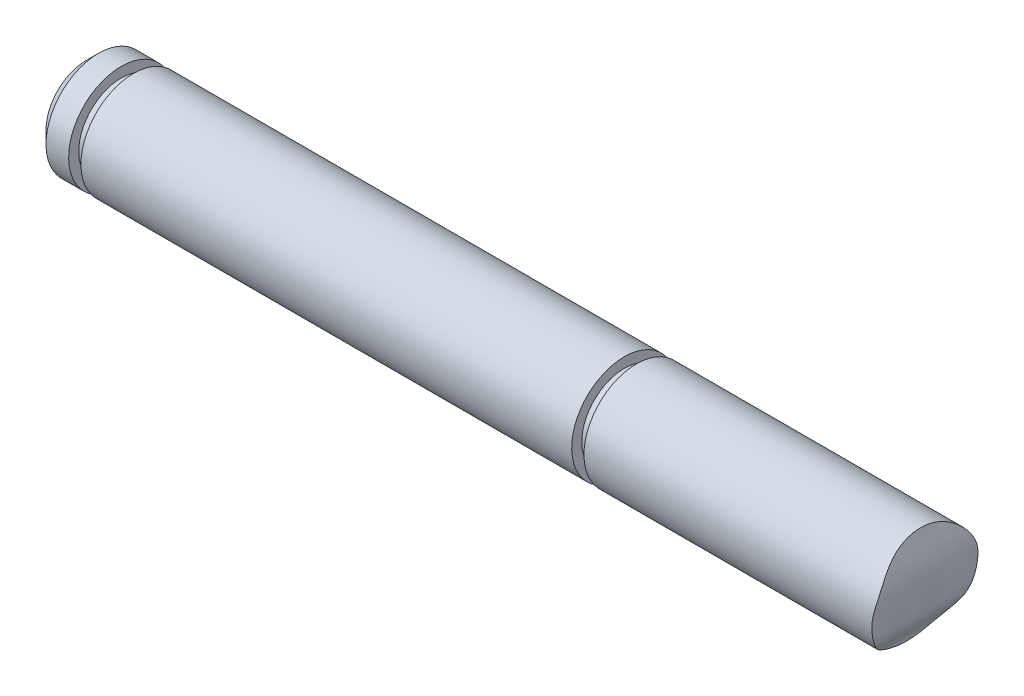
ISO-10303-21;
HEADER;
FILE_DESCRIPTION(('STEP AP214'),'2;1');
FILE_NAME('part.step','',(''),(''),'','','');
FILE_SCHEMA(('AUTOMOTIVE_DESIGN { 1 0 10303 214 1 1 1 1 }'));
ENDSEC;
DATA;
#1=APPLICATION_CONTEXT('core data for automotive mechanical design processes');
#2=APPLICATION_PROTOCOL_DEFINITION('international standard','automotive_design',2000,#1);
#3=PRODUCT_CONTEXT('',#1,'mechanical');
#4=PRODUCT('Part','Part','',(#3));
#5=PRODUCT_RELATED_PRODUCT_CATEGORY('part','',(#4));
#6=PRODUCT_DEFINITION_FORMATION('','',#4);
#7=PRODUCT_DEFINITION_CONTEXT('part definition',#1,'design');
#8=PRODUCT_DEFINITION('design','',#6,#7);
#9=PRODUCT_DEFINITION_SHAPE('','',#8);
#10=(LENGTH_UNIT() NAMED_UNIT(*) SI_UNIT(.MILLI.,.METRE.));
#11=(NAMED_UNIT(*) PLANE_ANGLE_UNIT() SI_UNIT($,.RADIAN.));
#12=(NAMED_UNIT(*) SI_UNIT($,.STERADIAN.) SOLID_ANGLE_UNIT());
#13=UNCERTAINTY_MEASURE_WITH_UNIT(LENGTH_MEASURE(1.E-05),#10,'distance_accuracy_value','');
#14=(GEOMETRIC_REPRESENTATION_CONTEXT(3) GLOBAL_UNCERTAINTY_ASSIGNED_CONTEXT((#13)) GLOBAL_UNIT_ASSIGNED_CONTEXT((#10,
#11,#12)) REPRESENTATION_CONTEXT('',''));
#15=CARTESIAN_POINT('',(0.,0.,0.));
#16=DIRECTION('',(0.,0.,1.));
#17=DIRECTION('',(1.,0.,0.));
#18=AXIS2_PLACEMENT_3D('',#15,#16,#17);
#19=CARTESIAN_POINT('',(19.4973294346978,5.21361750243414,0.));
#20=DIRECTION('',(1.,0.,0.));
#21=DIRECTION('',(0.,1.,0.));
#22=AXIS2_PLACEMENT_3D('',#19,#20,#21);
#23=CYLINDRICAL_SURFACE('',#22,3.);
#24=CARTESIAN_POINT('',(-0.502670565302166,5.21361750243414,0.));
#25=DIRECTION('',(1.,0.,0.));
#26=DIRECTION('',(0.,1.,0.));
#27=AXIS2_PLACEMENT_3D('',#24,#25,#26);
#28=CIRCLE('',#27,3.);
#29=CARTESIAN_POINT('',(-0.502670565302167,8.21361750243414,0.));
#30=VERTEX_POINT('',#29);
#31=EDGE_CURVE('E70',#30,#30,#28,.T.);
#32=ORIENTED_EDGE('',*,*,#31,.T.);
#33=EDGE_LOOP('',(#32));
#34=FACE_BOUND('',#33,.T.);
#35=CARTESIAN_POINT('',(15.700123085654,8.21361750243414,0.));
#36=CARTESIAN_POINT('',(15.7001231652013,8.21361762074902,-0.0832513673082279));
#37=CARTESIAN_POINT('',(15.7010054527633,8.2101497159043,-0.166500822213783));
#38=CARTESIAN_POINT('',(15.7045770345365,8.19630618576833,-0.332415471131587));
#39=CARTESIAN_POINT('',(15.7072669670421,8.18592812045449,-0.415080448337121));
#40=CARTESIAN_POINT('',(15.7145693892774,8.1583409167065,-0.579257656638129));
#41=CARTESIAN_POINT('',(15.7191837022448,8.14112530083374,-0.660768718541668));
#42=CARTESIAN_POINT('',(15.7304788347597,8.10002090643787,-0.821943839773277));
#43=CARTESIAN_POINT('',(15.7371596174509,8.07613224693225,-0.901607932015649));
#44=CARTESIAN_POINT('',(15.752521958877,8.02254549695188,-1.0566415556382));
#45=CARTESIAN_POINT('',(15.7611526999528,7.99299744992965,-1.13206804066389));
#46=CARTESIAN_POINT('',(15.7805163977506,7.92803252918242,-1.28002996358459));
#47=CARTESIAN_POINT('',(15.7912484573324,7.89261816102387,-1.35256661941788));
#48=CARTESIAN_POINT('',(15.8147072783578,7.81618899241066,-1.49436078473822));
#49=CARTESIAN_POINT('',(15.82743559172,7.77516983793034,-1.56361568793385));
#50=CARTESIAN_POINT('',(15.8545683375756,7.6878767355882,-1.69837785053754));
#51=CARTESIAN_POINT('',(15.8689727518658,7.64160284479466,-1.76388515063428));
#52=CARTESIAN_POINT('',(15.8991432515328,7.54336548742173,-1.89179195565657));
#53=CARTESIAN_POINT('',(15.9149267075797,7.49132622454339,-1.95412908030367));
#54=CARTESIAN_POINT('',(15.9468179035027,7.38241655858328,-2.07434067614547));
#55=CARTESIAN_POINT('',(15.9629256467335,7.32554610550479,-2.13221510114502));
#56=CARTESIAN_POINT('',(15.9942752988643,7.20727117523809,-2.24319278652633));
#57=CARTESIAN_POINT('',(16.0095184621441,7.14587358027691,-2.29630302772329));
#58=CARTESIAN_POINT('',(16.0376177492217,7.0186306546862,-2.3976099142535));
#59=CARTESIAN_POINT('',(16.0504748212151,6.95278710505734,-2.44580850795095));
#60=CARTESIAN_POINT('',(16.0655569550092,6.85670201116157,-2.51026354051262));
#61=CARTESIAN_POINT('',(16.069599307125,6.82818935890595,-2.52869794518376));
#62=CARTESIAN_POINT('',(16.0767419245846,6.77047063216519,-2.56463726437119));
#63=CARTESIAN_POINT('',(16.0798422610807,6.74126461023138,-2.58214224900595));
#64=CARTESIAN_POINT('',(16.0876081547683,6.65268618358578,-2.63319600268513));
#65=CARTESIAN_POINT('',(16.0907424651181,6.59232985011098,-2.66529939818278));
#66=CARTESIAN_POINT('',(16.0931009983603,6.46956896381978,-2.72529858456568));
#67=CARTESIAN_POINT('',(16.0923285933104,6.4071662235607,-2.75319798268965));
#68=CARTESIAN_POINT('',(16.0872824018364,6.28071424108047,-2.80463271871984));
#69=CARTESIAN_POINT('',(16.0830077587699,6.21666459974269,-2.82816698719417));
#70=CARTESIAN_POINT('',(16.0716253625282,6.08781434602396,-2.87060089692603));
#71=CARTESIAN_POINT('',(16.0645379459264,6.02302229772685,-2.88953226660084));
#72=CARTESIAN_POINT('',(16.0482894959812,5.89256889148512,-2.92293673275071));
#73=CARTESIAN_POINT('',(16.0391285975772,5.826907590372,-2.93741011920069));
#74=CARTESIAN_POINT('',(16.0195668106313,5.69485760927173,-2.96191218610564));
#75=CARTESIAN_POINT('',(16.0091643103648,5.62846808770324,-2.97193500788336));
#76=CARTESIAN_POINT('',(15.9880238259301,5.49522040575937,-2.98750729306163));
#77=CARTESIAN_POINT('',(15.977285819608,5.42836221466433,-2.99305646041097));
#78=CARTESIAN_POINT('',(15.954193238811,5.2802018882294,-3.00036109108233));
#79=CARTESIAN_POINT('',(15.9419744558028,5.19882310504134,-3.00107151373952));
#80=CARTESIAN_POINT('',(15.9199996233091,5.03593606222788,-2.99584044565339));
#81=CARTESIAN_POINT('',(15.9102439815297,4.95442778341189,-2.98989785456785));
#82=CARTESIAN_POINT('',(15.8914150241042,4.79205577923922,-2.97135851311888));
#83=CARTESIAN_POINT('',(15.8823420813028,4.71119242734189,-2.95875815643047));
#84=CARTESIAN_POINT('',(15.8631899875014,4.55088632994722,-2.92702224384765));
#85=CARTESIAN_POINT('',(15.8531110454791,4.47144329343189,-2.90788804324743));
#86=CARTESIAN_POINT('',(15.8318779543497,4.32502671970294,-2.86625431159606));
#87=CARTESIAN_POINT('',(15.821039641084,4.25778755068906,-2.84452855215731));
#88=CARTESIAN_POINT('',(15.7965285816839,4.12547019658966,-2.79658454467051));
#89=CARTESIAN_POINT('',(15.7828565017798,4.06039150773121,-2.77036735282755));
#90=CARTESIAN_POINT('',(15.7519808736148,3.93309858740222,-2.71387240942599));
#91=CARTESIAN_POINT('',(15.7347874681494,3.87087674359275,-2.68360640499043));
#92=CARTESIAN_POINT('',(15.7059668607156,3.7799849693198,-2.63550276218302));
#93=CARTESIAN_POINT('',(15.695857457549,3.75010082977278,-2.6190213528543));
#94=CARTESIAN_POINT('',(15.6745903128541,3.69118931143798,-2.58522050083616));
#95=CARTESIAN_POINT('',(15.6634325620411,3.66216194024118,-2.56790105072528));
#96=CARTESIAN_POINT('',(15.6368753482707,3.59730509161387,-2.52771747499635));
#97=CARTESIAN_POINT('',(15.6211441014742,3.56175553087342,-2.50461904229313));
#98=CARTESIAN_POINT('',(15.5879674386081,3.49220875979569,-2.45734072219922));
#99=CARTESIAN_POINT('',(15.5705217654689,3.45821178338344,-2.43316067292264));
#100=CARTESIAN_POINT('',(15.5345080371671,3.39157864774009,-2.38367338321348));
#101=CARTESIAN_POINT('',(15.5159383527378,3.35894458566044,-2.35836452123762));
#102=CARTESIAN_POINT('',(15.4781986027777,3.29495888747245,-2.30660805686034));
#103=CARTESIAN_POINT('',(15.4590285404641,3.2636072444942,-2.28016046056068));
#104=CARTESIAN_POINT('',(15.4011580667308,3.17105467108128,-2.19879909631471));
#105=CARTESIAN_POINT('',(15.362233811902,3.11159430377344,-2.14204403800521));
#106=CARTESIAN_POINT('',(15.2868820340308,2.99684153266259,-2.02304585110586));
#107=CARTESIAN_POINT('',(15.2504516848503,2.94154440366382,-1.96080912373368));
#108=CARTESIAN_POINT('',(15.1898248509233,2.84688466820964,-1.8446901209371));
#109=CARTESIAN_POINT('',(15.164698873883,2.80669003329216,-1.79197573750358));
#110=CARTESIAN_POINT('',(15.1180786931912,2.72920603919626,-1.68290605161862));
#111=CARTESIAN_POINT('',(15.0965846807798,2.6919168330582,-1.6265505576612));
#112=CARTESIAN_POINT('',(15.0576544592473,2.62079251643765,-1.51058625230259));
#113=CARTESIAN_POINT('',(15.0402074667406,2.5869483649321,-1.45098662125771));
#114=CARTESIAN_POINT('',(15.0092558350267,2.5230693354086,-1.3287975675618));
#115=CARTESIAN_POINT('',(14.9957513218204,2.49303457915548,-1.26620804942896));
#116=CARTESIAN_POINT('',(14.9723318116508,2.43723218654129,-1.1386495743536));
#117=CARTESIAN_POINT('',(14.9624105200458,2.41145711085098,-1.0736850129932));
#118=CARTESIAN_POINT('',(14.9455479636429,2.36440176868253,-0.941742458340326));
#119=CARTESIAN_POINT('',(14.9386082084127,2.34312378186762,-0.874763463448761));
#120=CARTESIAN_POINT('',(14.9270762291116,2.30524990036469,-0.739163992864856));
#121=CARTESIAN_POINT('',(14.9224885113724,2.28866302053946,-0.670540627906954));
#122=CARTESIAN_POINT('',(14.9151079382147,2.2603631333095,-0.532231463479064));
#123=CARTESIAN_POINT('',(14.9123144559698,2.24864842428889,-0.462546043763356));
#124=CARTESIAN_POINT('',(14.9079147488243,2.22945735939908,-0.31712734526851));
#125=CARTESIAN_POINT('',(14.9064155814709,2.22237336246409,-0.24133889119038));
#126=CARTESIAN_POINT('',(14.9046555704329,2.21398585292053,-0.0894288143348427));
#127=CARTESIAN_POINT('',(14.9043947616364,2.21268250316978,-0.0133071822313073));
#128=CARTESIAN_POINT('',(14.9050514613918,2.21586662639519,0.138876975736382));
#129=CARTESIAN_POINT('',(14.9059699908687,2.22035911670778,0.214939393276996));
#130=CARTESIAN_POINT('',(14.9091954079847,2.23511286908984,0.36647822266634));
#131=CARTESIAN_POINT('',(14.911502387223,2.24537451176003,0.441954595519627));
#132=CARTESIAN_POINT('',(14.9182351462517,2.27269622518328,0.598150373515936));
#133=CARTESIAN_POINT('',(14.9228229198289,2.29025581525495,0.678776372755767));
#134=CARTESIAN_POINT('',(14.9350259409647,2.33189017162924,0.838109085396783));
#135=CARTESIAN_POINT('',(14.9426413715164,2.35596533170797,0.916815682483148));
#136=CARTESIAN_POINT('',(14.9618650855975,2.41020565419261,1.07123721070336));
#137=CARTESIAN_POINT('',(14.9734564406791,2.44034477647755,1.14696333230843));
#138=CARTESIAN_POINT('',(15.0015443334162,2.50628408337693,1.29495318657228));
#139=CARTESIAN_POINT('',(15.0180394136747,2.54208258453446,1.36721794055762));
#140=CARTESIAN_POINT('',(15.0544232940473,2.61465673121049,1.50017537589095));
#141=CARTESIAN_POINT('',(15.0737750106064,2.65093647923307,1.56128699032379));
#142=CARTESIAN_POINT('',(15.1167274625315,2.72696350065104,1.67973380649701));
#143=CARTESIAN_POINT('',(15.1403281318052,2.7667107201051,1.73706906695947));
#144=CARTESIAN_POINT('',(15.1913660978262,2.84943649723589,1.84809961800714));
#145=CARTESIAN_POINT('',(15.2188244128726,2.89243211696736,1.90177239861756));
#146=CARTESIAN_POINT('',(15.2764827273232,2.98118202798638,2.00521327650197));
#147=CARTESIAN_POINT('',(15.3066832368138,3.0269368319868,2.05498064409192));
#148=CARTESIAN_POINT('',(15.3692843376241,3.12242073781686,2.15212855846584));
#149=CARTESIAN_POINT('',(15.401721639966,3.17222205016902,2.19941399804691));
#150=CARTESIAN_POINT('',(15.4663169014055,3.27504173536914,2.2905558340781));
#151=CARTESIAN_POINT('',(15.4984748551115,3.32806017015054,2.33441216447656));
#152=CARTESIAN_POINT('',(15.5600904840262,3.43754571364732,2.41874177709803));
#153=CARTESIAN_POINT('',(15.5895655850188,3.49398589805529,2.45923671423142));
#154=CARTESIAN_POINT('',(15.6435472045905,3.6111893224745,2.53715386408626));
#155=CARTESIAN_POINT('',(15.6680558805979,3.67195066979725,2.57457740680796));
#156=CARTESIAN_POINT('',(15.7156793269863,3.80661647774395,2.65088656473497));
#157=CARTESIAN_POINT('',(15.7380447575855,3.88113170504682,2.68916193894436));
#158=CARTESIAN_POINT('',(15.7773357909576,4.03433834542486,2.75978629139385));
#159=CARTESIAN_POINT('',(15.7942573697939,4.11303279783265,2.79213087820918));
#160=CARTESIAN_POINT('',(15.8240180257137,4.2740473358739,2.85036576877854));
#161=CARTESIAN_POINT('',(15.8368319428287,4.35638637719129,2.87621609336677));
#162=CARTESIAN_POINT('',(15.8598996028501,4.52330513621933,2.92077529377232));
#163=CARTESIAN_POINT('',(15.8701537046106,4.60788453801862,2.93948517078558));
#164=CARTESIAN_POINT('',(15.8858521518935,4.74266847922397,2.96323155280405));
#165=CARTESIAN_POINT('',(15.8915120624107,4.79243204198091,2.97071273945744));
#166=CARTESIAN_POINT('',(15.9030055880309,4.89224652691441,2.98316078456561));
#167=CARTESIAN_POINT('',(15.9088391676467,4.94229738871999,2.98812815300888));
#168=CARTESIAN_POINT('',(15.9211122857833,5.04250170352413,2.99553715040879));
#169=CARTESIAN_POINT('',(15.9275516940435,5.09265513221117,2.99797932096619));
#170=CARTESIAN_POINT('',(15.9413530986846,5.19291010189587,3.00034791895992));
#171=CARTESIAN_POINT('',(15.9487153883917,5.24301162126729,3.00027354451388));
#172=CARTESIAN_POINT('',(15.963926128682,5.34308523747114,2.99762299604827));
#173=CARTESIAN_POINT('',(15.9717746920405,5.39305730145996,2.99504623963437));
#174=CARTESIAN_POINT('',(15.9875927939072,5.49279907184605,2.98740028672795));
#175=CARTESIAN_POINT('',(15.9955623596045,5.54256872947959,2.98233052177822));
#176=CARTESIAN_POINT('',(16.0166579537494,5.67616131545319,2.96533554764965));
#177=CARTESIAN_POINT('',(16.0295402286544,5.75974177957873,2.95109398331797));
#178=CARTESIAN_POINT('',(16.0527695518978,5.92574589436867,2.91548936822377));
#179=CARTESIAN_POINT('',(16.0631164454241,6.00816947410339,2.89412588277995));
#180=CARTESIAN_POINT('',(16.0796058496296,6.17087651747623,2.84444175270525));
#181=CARTESIAN_POINT('',(16.0857700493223,6.25116891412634,2.81615804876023));
#182=CARTESIAN_POINT('',(16.0926903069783,6.40922882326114,2.75277220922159));
#183=CARTESIAN_POINT('',(16.0934496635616,6.48699784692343,2.71767424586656));
#184=CARTESIAN_POINT('',(16.0890820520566,6.62974991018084,2.6457790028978));
#185=CARTESIAN_POINT('',(16.0846681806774,6.69512842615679,2.60972276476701));
#186=CARTESIAN_POINT('',(16.0710198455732,6.8226565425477,2.53308784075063));
#187=CARTESIAN_POINT('',(16.0617840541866,6.88480524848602,2.49250791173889));
#188=CARTESIAN_POINT('',(16.0402013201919,7.00583861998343,2.40696136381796));
#189=CARTESIAN_POINT('',(16.0278401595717,7.06470682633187,2.36197528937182));
#190=CARTESIAN_POINT('',(16.0014354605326,7.17873569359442,2.2679880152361));
#191=CARTESIAN_POINT('',(15.987391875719,7.23389625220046,2.21898670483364));
#192=CARTESIAN_POINT('',(15.9589414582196,7.3396146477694,2.117878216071));
#193=CARTESIAN_POINT('',(15.9445428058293,7.39022747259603,2.06582614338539));
#194=CARTESIAN_POINT('',(15.9160117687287,7.48757760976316,1.95815521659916));
#195=CARTESIAN_POINT('',(15.9018793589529,7.53431528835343,1.90253670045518));
#196=CARTESIAN_POINT('',(15.8745160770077,7.62365672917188,1.78800896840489));
#197=CARTESIAN_POINT('',(15.8612837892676,7.66626702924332,1.729105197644));
#198=CARTESIAN_POINT('',(15.8361257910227,7.74721557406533,1.60815938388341));
#199=CARTESIAN_POINT('',(15.8242001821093,7.78555348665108,1.54611709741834));
#200=CARTESIAN_POINT('',(15.8000555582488,7.86378765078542,1.40849922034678));
#201=CARTESIAN_POINT('',(15.7881246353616,7.90286122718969,1.33240268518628));
#202=CARTESIAN_POINT('',(15.7666173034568,7.97447550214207,1.17685839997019));
#203=CARTESIAN_POINT('',(15.7570413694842,8.0070148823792,1.09740997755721));
#204=CARTESIAN_POINT('',(15.7402502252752,8.06520218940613,0.935857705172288));
#205=CARTESIAN_POINT('',(15.7330331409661,8.09085558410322,0.853756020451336));
#206=CARTESIAN_POINT('',(15.7208286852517,8.13504634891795,0.687497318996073));
#207=CARTESIAN_POINT('',(15.7158413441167,8.15358362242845,0.603340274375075));
#208=CARTESIAN_POINT('',(15.7079068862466,8.18347238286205,0.433007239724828));
#209=CARTESIAN_POINT('',(15.7049754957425,8.1947684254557,0.346820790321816));
#210=CARTESIAN_POINT('',(15.7010836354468,8.20984061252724,0.173755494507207));
#211=CARTESIAN_POINT('',(15.7001230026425,8.21361737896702,0.0868767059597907));
#212=CARTESIAN_POINT('',(15.700123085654,8.21361750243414,0.));
#213=B_SPLINE_CURVE_WITH_KNOTS('',3,(#35,#36,#37,#38,#39,#40,#41,#42,#43,#44,#45,#46,#47,#48,
#49,#50,#51,#52,#53,#54,#55,#56,#57,#58,#59,#60,#61,#62,#63,#64,#65,#66,#67,#68,#69,#70,#71,#72,
#73,#74,#75,#76,#77,#78,#79,#80,#81,#82,#83,#84,#85,#86,#87,#88,#89,#90,#91,#92,#93,#94,#95,#96,
#97,#98,#99,#100,#101,#102,#103,#104,#105,#106,#107,#108,#109,#110,#111,#112,#113,#114,#115,
#116,#117,#118,#119,#120,#121,#122,#123,#124,#125,#126,#127,#128,#129,#130,#131,#132,#133,#134,
#135,#136,#137,#138,#139,#140,#141,#142,#143,#144,#145,#146,#147,#148,#149,#150,#151,#152,#153,
#154,#155,#156,#157,#158,#159,#160,#161,#162,#163,#164,#165,#166,#167,#168,#169,#170,#171,#172,
#173,#174,#175,#176,#177,#178,#179,#180,#181,#182,#183,#184,#185,#186,#187,#188,#189,#190,#191,
#192,#193,#194,#195,#196,#197,#198,#199,#200,#201,#202,#203,#204,#205,#206,#207,#208,#209,#210,
#211,#212),.UNSPECIFIED.,.T.,.F.,(4,2,2,2,2,2,2,2,2,2,2,2,2,2,2,2,2,2,2,2,2,2,2,2,2,2,2,2,2,2,2,
2,2,2,2,2,2,2,2,2,2,2,2,2,2,2,2,2,2,2,2,2,2,2,2,2,2,2,2,2,2,2,2,2,2,2,2,2,2,2,2,2,2,2,2,2,2,2,2,
2,2,2,2,2,2,2,2,2,4),(0.,0.249673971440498,0.499436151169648,0.749435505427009,
0.999430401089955,1.24353854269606,1.48754269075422,1.73173748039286,1.97592961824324,
2.22383381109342,2.47174056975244,2.7192779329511,2.96671671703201,3.06926803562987,
3.17181160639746,3.37681311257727,3.58163770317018,3.78651240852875,3.98993207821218,
4.19333851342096,4.39701192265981,4.60069880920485,4.84728108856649,5.0939041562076,
5.34066094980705,5.58736659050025,5.80161994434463,6.01582298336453,6.22941749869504,
6.336167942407,6.44291933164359,6.57849828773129,6.71409760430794,6.8498984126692,
6.98569849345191,7.25827655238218,7.53054042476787,7.7429977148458,7.95546618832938,
8.16736185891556,8.37926430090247,8.59079266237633,8.80242799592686,9.01446730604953,
9.22643249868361,9.45459782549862,9.68276958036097,9.91113899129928,10.1395234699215,
10.3871308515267,10.634753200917,10.8813340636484,11.1278417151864,11.3485061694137,
11.569167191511,11.7910808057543,12.0130357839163,12.2407351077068,12.468438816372,
12.6945385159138,12.920539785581,13.1801510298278,13.4399537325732,13.7013186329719,
13.9626468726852,14.1145129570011,14.2663482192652,14.4181509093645,14.5700019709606,
14.7218883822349,14.8738094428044,15.1307482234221,15.3877026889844,15.6433143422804,
15.8987699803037,16.1227791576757,16.3468500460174,16.5719592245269,16.7970746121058,
17.0189373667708,17.2407791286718,17.4622635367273,17.6837651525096,17.9425264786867,
18.2013399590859,18.4599473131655,18.7185581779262,18.9791262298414,19.2396727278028),.UNSPECIFIED.);
#214=CARTESIAN_POINT('',(15.700123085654,8.21361750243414,0.));
#215=VERTEX_POINT('',#214);
#216=EDGE_CURVE('E35',#215,#215,#213,.T.);
#217=ORIENTED_EDGE('',*,*,#216,.T.);
#218=EDGE_LOOP('',(#217));
#219=FACE_BOUND('',#218,.T.);
#220=ADVANCED_FACE('F31',(#34,#219),#23,.T.);
#221=CARTESIAN_POINT('',(-31.9026705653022,5.21361750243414,0.));
#222=DIRECTION('',(-1.,0.,0.));
#223=DIRECTION('',(0.,-1.,0.));
#224=AXIS2_PLACEMENT_3D('',#221,#222,#223);
#225=PLANE('',#224);
#226=CARTESIAN_POINT('',(-31.9026705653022,5.21361750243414,0.));
#227=DIRECTION('',(1.,0.,0.));
#228=DIRECTION('',(0.,1.,0.));
#229=AXIS2_PLACEMENT_3D('',#226,#227,#228);
#230=CIRCLE('',#229,2.29289321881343);
#231=CARTESIAN_POINT('',(-31.9026705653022,7.50651072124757,0.));
#232=VERTEX_POINT('',#231);
#233=EDGE_CURVE('E10',#232,#232,#230,.T.);
#234=ORIENTED_EDGE('',*,*,#233,.F.);
#235=EDGE_LOOP('',(#234));
#236=FACE_BOUND('',#235,.T.);
#237=ADVANCED_FACE('F33',(#236),#225,.T.);
#238=CARTESIAN_POINT('',(-31.1955637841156,5.21361750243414,0.));
#239=DIRECTION('',(1.,0.,0.));
#240=DIRECTION('',(0.,1.,0.));
#241=AXIS2_PLACEMENT_3D('',#238,#239,#240);
#242=CONICAL_SURFACE('',#241,2.99999999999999,0.785398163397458);
#243=ORIENTED_EDGE('',*,*,#233,.T.);
#244=EDGE_LOOP('',(#243));
#245=FACE_BOUND('',#244,.T.);
#246=CARTESIAN_POINT('',(-31.1955637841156,5.21361750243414,0.));
#247=DIRECTION('',(1.,0.,0.));
#248=DIRECTION('',(0.,1.,0.));
#249=AXIS2_PLACEMENT_3D('',#246,#247,#248);
#250=CIRCLE('',#249,2.99999999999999);
#251=CARTESIAN_POINT('',(-31.1955637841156,8.21361750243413,0.));
#252=VERTEX_POINT('',#251);
#253=EDGE_CURVE('E43',#252,#252,#250,.T.);
#254=ORIENTED_EDGE('',*,*,#253,.F.);
#255=EDGE_LOOP('',(#254));
#256=FACE_BOUND('',#255,.T.);
#257=ADVANCED_FACE('F117',(#245,#256),#242,.T.);
#258=CARTESIAN_POINT('',(19.4973294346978,5.21361750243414,0.));
#259=DIRECTION('',(1.,0.,0.));
#260=DIRECTION('',(0.,1.,0.));
#261=AXIS2_PLACEMENT_3D('',#258,#259,#260);
#262=CYLINDRICAL_SURFACE('',#261,2.99999999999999);
#263=ORIENTED_EDGE('',*,*,#253,.T.);
#264=EDGE_LOOP('',(#263));
#265=FACE_BOUND('',#264,.T.);
#266=CARTESIAN_POINT('',(-29.9026705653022,5.21361750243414,0.));
#267=DIRECTION('',(1.,0.,0.));
#268=DIRECTION('',(0.,1.,0.));
#269=AXIS2_PLACEMENT_3D('',#266,#267,#268);
#270=CIRCLE('',#269,2.99999999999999);
#271=CARTESIAN_POINT('',(-29.9026705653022,8.21361750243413,0.));
#272=VERTEX_POINT('',#271);
#273=EDGE_CURVE('E47',#272,#272,#270,.T.);
#274=ORIENTED_EDGE('',*,*,#273,.F.);
#275=EDGE_LOOP('',(#274));
#276=FACE_BOUND('',#275,.T.);
#277=ADVANCED_FACE('F114',(#265,#276),#262,.T.);
#278=CARTESIAN_POINT('',(-29.9026705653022,8.21361750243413,0.));
#279=DIRECTION('',(1.,0.,0.));
#280=DIRECTION('',(0.,1.,0.));
#281=AXIS2_PLACEMENT_3D('',#278,#279,#280);
#282=PLANE('',#281);
#283=ORIENTED_EDGE('',*,*,#273,.T.);
#284=EDGE_LOOP('',(#283));
#285=FACE_BOUND('',#284,.T.);
#286=CARTESIAN_POINT('',(-29.9026705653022,5.21361750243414,0.));
#287=DIRECTION('',(1.,0.,0.));
#288=DIRECTION('',(0.,1.,0.));
#289=AXIS2_PLACEMENT_3D('',#286,#287,#288);
#290=CIRCLE('',#289,2.425);
#291=CARTESIAN_POINT('',(-29.9026705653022,7.63861750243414,0.));
#292=VERTEX_POINT('',#291);
#293=EDGE_CURVE('E52',#292,#292,#290,.T.);
#294=ORIENTED_EDGE('',*,*,#293,.F.);
#295=EDGE_LOOP('',(#294));
#296=FACE_BOUND('',#295,.T.);
#297=ADVANCED_FACE('F110',(#285,#296),#282,.T.);
#298=CARTESIAN_POINT('',(19.4973294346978,5.21361750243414,0.));
#299=DIRECTION('',(1.,0.,0.));
#300=DIRECTION('',(0.,1.,0.));
#301=AXIS2_PLACEMENT_3D('',#298,#299,#300);
#302=CYLINDRICAL_SURFACE('',#301,2.425);
#303=ORIENTED_EDGE('',*,*,#293,.T.);
#304=EDGE_LOOP('',(#303));
#305=FACE_BOUND('',#304,.T.);
#306=CARTESIAN_POINT('',(-29.2026705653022,5.21361750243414,0.));
#307=DIRECTION('',(1.,0.,0.));
#308=DIRECTION('',(0.,1.,0.));
#309=AXIS2_PLACEMENT_3D('',#306,#307,#308);
#310=CIRCLE('',#309,2.425);
#311=CARTESIAN_POINT('',(-29.2026705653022,7.63861750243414,0.));
#312=VERTEX_POINT('',#311);
#313=EDGE_CURVE('E55',#312,#312,#310,.T.);
#314=ORIENTED_EDGE('',*,*,#313,.F.);
#315=EDGE_LOOP('',(#314));
#316=FACE_BOUND('',#315,.T.);
#317=ADVANCED_FACE('F106',(#305,#316),#302,.T.);
#318=CARTESIAN_POINT('',(-29.2026705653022,7.63861750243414,0.));
#319=DIRECTION('',(-1.,0.,0.));
#320=DIRECTION('',(0.,-1.,0.));
#321=AXIS2_PLACEMENT_3D('',#318,#319,#320);
#322=PLANE('',#321);
#323=ORIENTED_EDGE('',*,*,#313,.T.);
#324=EDGE_LOOP('',(#323));
#325=FACE_BOUND('',#324,.T.);
#326=CARTESIAN_POINT('',(-29.2026705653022,5.21361750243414,0.));
#327=DIRECTION('',(1.,0.,0.));
#328=DIRECTION('',(0.,1.,0.));
#329=AXIS2_PLACEMENT_3D('',#326,#327,#328);
#330=CIRCLE('',#329,3.00000000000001);
#331=CARTESIAN_POINT('',(-29.2026705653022,8.21361750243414,0.));
#332=VERTEX_POINT('',#331);
#333=EDGE_CURVE('E58',#332,#332,#330,.T.);
#334=ORIENTED_EDGE('',*,*,#333,.F.);
#335=EDGE_LOOP('',(#334));
#336=FACE_BOUND('',#335,.T.);
#337=ADVANCED_FACE('F102',(#325,#336),#322,.T.);
#338=CARTESIAN_POINT('',(19.4973294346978,5.21361750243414,0.));
#339=DIRECTION('',(1.,0.,0.));
#340=DIRECTION('',(0.,1.,0.));
#341=AXIS2_PLACEMENT_3D('',#338,#339,#340);
#342=CYLINDRICAL_SURFACE('',#341,3.);
#343=ORIENTED_EDGE('',*,*,#333,.T.);
#344=EDGE_LOOP('',(#343));
#345=FACE_BOUND('',#344,.T.);
#346=CARTESIAN_POINT('',(-1.20267056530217,5.21361750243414,0.));
#347=DIRECTION('',(1.,0.,0.));
#348=DIRECTION('',(0.,1.,0.));
#349=AXIS2_PLACEMENT_3D('',#346,#347,#348);
#350=CIRCLE('',#349,3.);
#351=CARTESIAN_POINT('',(-1.20267056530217,8.21361750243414,0.));
#352=VERTEX_POINT('',#351);
#353=EDGE_CURVE('E61',#352,#352,#350,.T.);
#354=ORIENTED_EDGE('',*,*,#353,.F.);
#355=EDGE_LOOP('',(#354));
#356=FACE_BOUND('',#355,.T.);
#357=ADVANCED_FACE('F98',(#345,#356),#342,.T.);
#358=CARTESIAN_POINT('',(-1.20267056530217,8.21361750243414,0.));
#359=DIRECTION('',(1.,0.,0.));
#360=DIRECTION('',(0.,1.,0.));
#361=AXIS2_PLACEMENT_3D('',#358,#359,#360);
#362=PLANE('',#361);
#363=ORIENTED_EDGE('',*,*,#353,.T.);
#364=EDGE_LOOP('',(#363));
#365=FACE_BOUND('',#364,.T.);
#366=CARTESIAN_POINT('',(-1.20267056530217,5.21361750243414,0.));
#367=DIRECTION('',(1.,0.,0.));
#368=DIRECTION('',(0.,1.,0.));
#369=AXIS2_PLACEMENT_3D('',#366,#367,#368);
#370=CIRCLE('',#369,2.425);
#371=CARTESIAN_POINT('',(-1.20267056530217,7.63861750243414,0.));
#372=VERTEX_POINT('',#371);
#373=EDGE_CURVE('E64',#372,#372,#370,.T.);
#374=ORIENTED_EDGE('',*,*,#373,.F.);
#375=EDGE_LOOP('',(#374));
#376=FACE_BOUND('',#375,.T.);
#377=ADVANCED_FACE('F94',(#365,#376),#362,.T.);
#378=CARTESIAN_POINT('',(19.4973294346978,5.21361750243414,0.));
#379=DIRECTION('',(1.,0.,0.));
#380=DIRECTION('',(0.,1.,0.));
#381=AXIS2_PLACEMENT_3D('',#378,#379,#380);
#382=CYLINDRICAL_SURFACE('',#381,2.425);
#383=ORIENTED_EDGE('',*,*,#373,.T.);
#384=EDGE_LOOP('',(#383));
#385=FACE_BOUND('',#384,.T.);
#386=CARTESIAN_POINT('',(-0.502670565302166,5.21361750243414,0.));
#387=DIRECTION('',(1.,0.,0.));
#388=DIRECTION('',(0.,1.,0.));
#389=AXIS2_PLACEMENT_3D('',#386,#387,#388);
#390=CIRCLE('',#389,2.425);
#391=CARTESIAN_POINT('',(-0.502670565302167,7.63861750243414,0.));
#392=VERTEX_POINT('',#391);
#393=EDGE_CURVE('E67',#392,#392,#390,.T.);
#394=ORIENTED_EDGE('',*,*,#393,.F.);
#395=EDGE_LOOP('',(#394));
#396=FACE_BOUND('',#395,.T.);
#397=ADVANCED_FACE('F90',(#385,#396),#382,.T.);
#398=CARTESIAN_POINT('',(-0.502670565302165,7.63861750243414,0.));
#399=DIRECTION('',(-1.,0.,0.));
#400=DIRECTION('',(0.,-1.,0.));
#401=AXIS2_PLACEMENT_3D('',#398,#399,#400);
#402=PLANE('',#401);
#403=ORIENTED_EDGE('',*,*,#393,.T.);
#404=EDGE_LOOP('',(#403));
#405=FACE_BOUND('',#404,.T.);
#406=ORIENTED_EDGE('',*,*,#31,.F.);
#407=EDGE_LOOP('',(#406));
#408=FACE_BOUND('',#407,.T.);
#409=ADVANCED_FACE('F82',(#405,#408),#402,.T.);
#410=CARTESIAN_POINT('',(16.4294602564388,10.7172339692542,65.1196015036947));
#411=CARTESIAN_POINT('',(16.0377549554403,10.1421288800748,65.1196015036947));
#412=CARTESIAN_POINT('',(15.1923695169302,8.90092671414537,65.1196015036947));
#413=CARTESIAN_POINT('',(16.3144612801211,6.95451812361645,65.1196015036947));
#414=CARTESIAN_POINT('',(15.8779577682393,5.14052711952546,65.1196015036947));
#415=CARTESIAN_POINT('',(15.820018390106,3.51053906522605,65.1196015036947));
#416=CARTESIAN_POINT('',(14.6219093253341,2.30773408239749,65.1196015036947));
#417=CARTESIAN_POINT('',(15.1401735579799,0.770461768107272,65.1196015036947));
#418=CARTESIAN_POINT('',(15.8471217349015,0.23931747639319,65.1196015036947));
#419=CARTESIAN_POINT('',(16.1656510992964,0.,65.1196015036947));
#420=B_SPLINE_CURVE_WITH_KNOTS('',3,(#410,#411,#412,#413,#414,#415,#416,#417,#418,#419),
.UNSPECIFIED.,.F.,.F.,(4,1,1,1,1,1,1,4),(0.,0.16731055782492,0.361092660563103,
0.503161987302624,0.642416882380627,0.771288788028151,0.896949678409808,1.),.UNSPECIFIED.);
#421=DIRECTION('',(0.,0.,-1.));
#422=VECTOR('',#421,1.);
#423=SURFACE_OF_LINEAR_EXTRUSION('',#420,#422);
#424=ORIENTED_EDGE('',*,*,#216,.F.);
#425=EDGE_LOOP('',(#424));
#426=FACE_BOUND('',#425,.T.);
#427=ADVANCED_FACE('F79',(#426),#423,.T.);
#428=CLOSED_SHELL('',(#220,#237,#257,#277,#297,#317,#337,#357,#377,#397,#409,#427));
#429=MANIFOLD_SOLID_BREP('B2',#428);
#430=ADVANCED_BREP_SHAPE_REPRESENTATION('',(#18,#429),#14);
#431=SHAPE_DEFINITION_REPRESENTATION(#9,#430);
ENDSEC;
END-ISO-10303-21;
